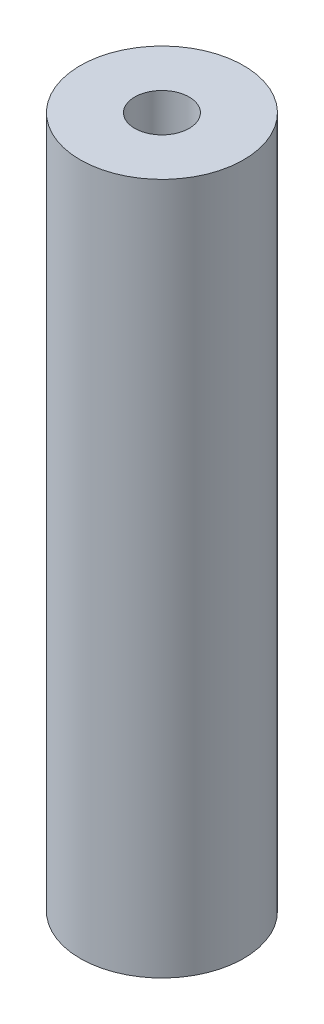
from build123d import *

# Parameters (mm, degrees)
ESQUISSE1_R        = 15
ESQUISSE1_R_2      = 5
BOSS_EXTRU_1_DEPTH = 127


with BuildPart() as part:
    # Esquisse1 → Boss.-Extru.1 (new body)
    with BuildSketch(Plane(origin=(0, 0, 0), x_dir=(1, 0, 0), z_dir=(0, 1, 0))):
        with Locations(Location((0, 0, 0), (0, 0, 270))):
            Circle(ESQUISSE1_R)
        with Locations(Location((0, 0, 0), (0, 0, 270))):
            Circle(ESQUISSE1_R_2, mode=Mode.SUBTRACT)
    extrude(amount=BOSS_EXTRU_1_DEPTH)


solid = part.part
